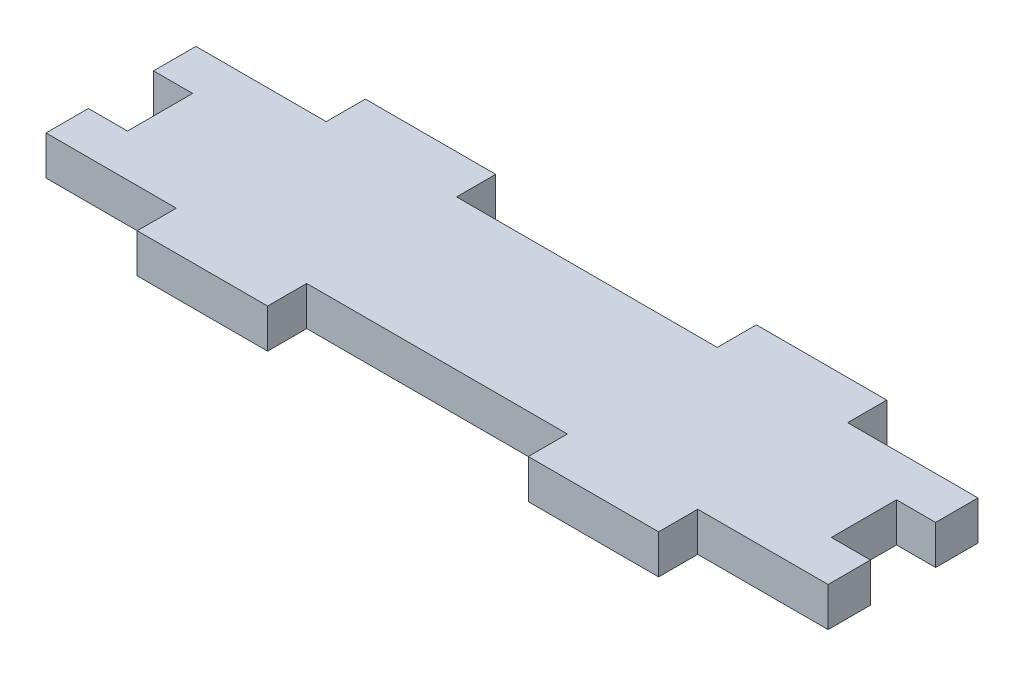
from build123d import *

# Parameters (mm, degrees)
CROQUIS1_W                 = 60
CROQUIS1_H                 = 17.5
SALIENTE_EXTRUIR1_DEPTH    = 3
CROQUIS3_W                 = 3
CROQUIS3_H                 = 5
CORTAR_EXTRUIR3_DEPTH      = 3
CORTAR_EXTRUIR4_DEPTH      = 159.306237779
CORTAR_EXTRUIR4_DEPTH_BACK = 159.306237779
CROQUIS4_W                 = 10
CROQUIS4_H                 = 3
CROQUIS4_W_2               = 20


with BuildPart() as part:
    # Croquis1 → Saliente-Extruir1 (new body)
    with BuildSketch(Plane(origin=(0, 0, 0), x_dir=(1, 0, 0), z_dir=(0, 1, 0))):
        with Locations((0, 2.25)):
            Rectangle(CROQUIS1_W, CROQUIS1_H)
    extrude(amount=SALIENTE_EXTRUIR1_DEPTH)

    # Croquis3 → Cortar-Extruir3 (cut)
    with BuildSketch(Plane(origin=(0, 3, 0), x_dir=(1, 0, 0), z_dir=(0, 1, 0))):
        with Locations((-28.5, 2.25)):
            Rectangle(CROQUIS3_W, CROQUIS3_H)
    cortar_extruir3 = extrude(amount=-CORTAR_EXTRUIR3_DEPTH, mode=Mode.SUBTRACT)

    # Simetr_a1: Cortar-Extruir3 across plane
    add(cortar_extruir3.mirror(Plane(origin=(0, 0, 0), x_dir=(0, 0, 1), z_dir=(1, 0, 0))), mode=Mode.SUBTRACT)

    # Croquis4 → Cortar-Extruir4 (cut, two sides: drawn at the far end of the back side and taken through both)
    with BuildSketch(Plane(origin=(76.045343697, 0, -111), x_dir=(1, 0, 0), z_dir=(0, -1, 0)).offset(-CORTAR_EXTRUIR4_DEPTH_BACK)):
        with Locations((-101.045343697, 101.5)):
            Rectangle(CROQUIS4_W, CROQUIS4_H)
        with Locations((-76.045343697, 101.5)):
            Rectangle(CROQUIS4_W_2, CROQUIS4_H)
        with Locations((-51.045343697, 101.5)):
            Rectangle(CROQUIS4_W, CROQUIS4_H)
        with Locations((-51.045343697, 116)):
            Rectangle(CROQUIS4_W, CROQUIS4_H)
        with Locations((-76.045343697, 116)):
            Rectangle(CROQUIS4_W_2, CROQUIS4_H)
        with Locations((-101.045343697, 116)):
            Rectangle(CROQUIS4_W, CROQUIS4_H)
    extrude(amount=CORTAR_EXTRUIR4_DEPTH + CORTAR_EXTRUIR4_DEPTH_BACK, mode=Mode.SUBTRACT)


solid = part.part
